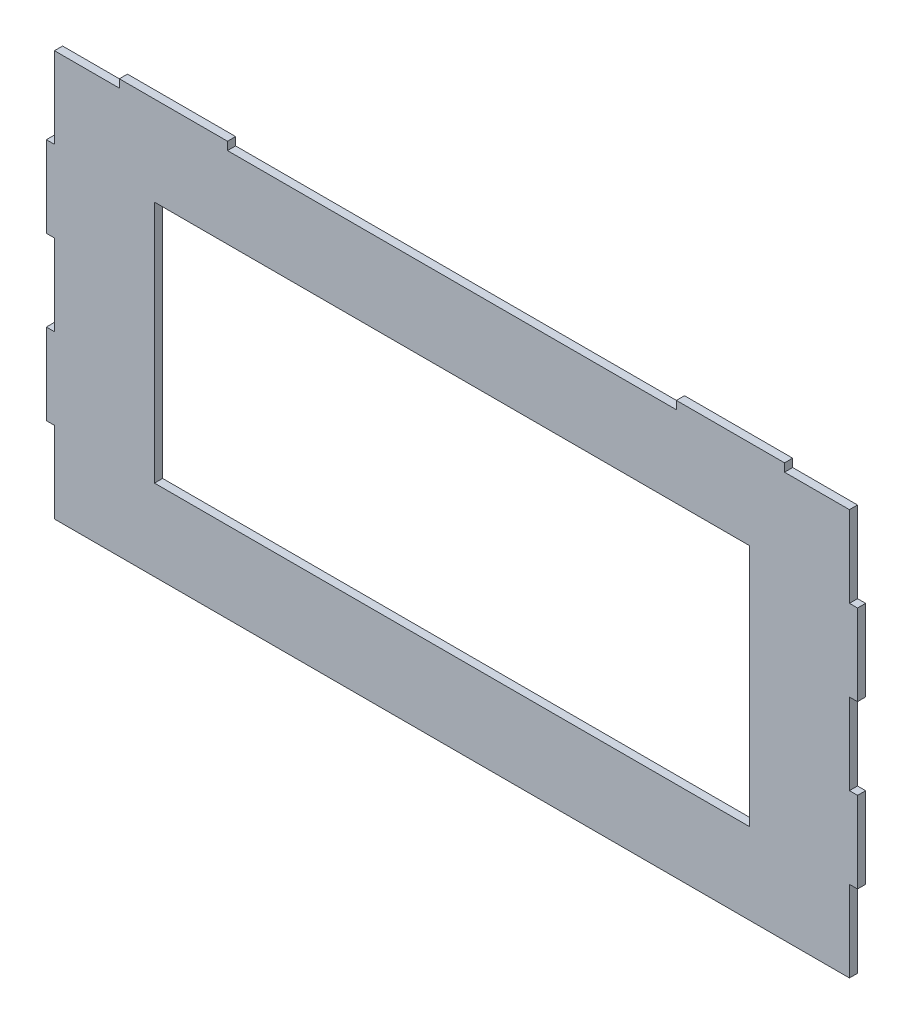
ISO-10303-21;
HEADER;
FILE_DESCRIPTION(('STEP AP214'),'2;1');
FILE_NAME('part.step','',(''),(''),'','','');
FILE_SCHEMA(('AUTOMOTIVE_DESIGN { 1 0 10303 214 1 1 1 1 }'));
ENDSEC;
DATA;
#1=APPLICATION_CONTEXT('core data for automotive mechanical design processes');
#2=APPLICATION_PROTOCOL_DEFINITION('international standard','automotive_design',2000,#1);
#3=PRODUCT_CONTEXT('',#1,'mechanical');
#4=PRODUCT('Part','Part','',(#3));
#5=PRODUCT_RELATED_PRODUCT_CATEGORY('part','',(#4));
#6=PRODUCT_DEFINITION_FORMATION('','',#4);
#7=PRODUCT_DEFINITION_CONTEXT('part definition',#1,'design');
#8=PRODUCT_DEFINITION('design','',#6,#7);
#9=PRODUCT_DEFINITION_SHAPE('','',#8);
#10=(LENGTH_UNIT() NAMED_UNIT(*) SI_UNIT(.MILLI.,.METRE.));
#11=(NAMED_UNIT(*) PLANE_ANGLE_UNIT() SI_UNIT($,.RADIAN.));
#12=(NAMED_UNIT(*) SI_UNIT($,.STERADIAN.) SOLID_ANGLE_UNIT());
#13=UNCERTAINTY_MEASURE_WITH_UNIT(LENGTH_MEASURE(1.E-05),#10,'distance_accuracy_value','');
#14=(GEOMETRIC_REPRESENTATION_CONTEXT(3) GLOBAL_UNCERTAINTY_ASSIGNED_CONTEXT((#13)) GLOBAL_UNIT_ASSIGNED_CONTEXT((#10,
#11,#12)) REPRESENTATION_CONTEXT('',''));
#15=CARTESIAN_POINT('',(0.,0.,0.));
#16=DIRECTION('',(0.,0.,1.));
#17=DIRECTION('',(1.,0.,0.));
#18=AXIS2_PLACEMENT_3D('',#15,#16,#17);
#19=CARTESIAN_POINT('',(-147.,-75.,3.));
#20=DIRECTION('',(1.,0.,0.));
#21=DIRECTION('',(0.,0.,-1.));
#22=AXIS2_PLACEMENT_3D('',#19,#20,#21);
#23=PLANE('',#22);
#24=DIRECTION('',(0.,0.,1.));
#25=VECTOR('',#24,1.);
#26=CARTESIAN_POINT('',(-147.,-45.,0.));
#27=LINE('',#26,#25);
#28=CARTESIAN_POINT('',(-147.,-45.,0.));
#29=VERTEX_POINT('',#28);
#30=CARTESIAN_POINT('',(-147.,-45.,3.));
#31=VERTEX_POINT('',#30);
#32=EDGE_CURVE('E578',#29,#31,#27,.T.);
#33=ORIENTED_EDGE('',*,*,#32,.F.);
#34=DIRECTION('',(0.,-1.,0.));
#35=VECTOR('',#34,1.);
#36=CARTESIAN_POINT('',(-147.,-75.,0.));
#37=LINE('',#36,#35);
#38=CARTESIAN_POINT('',(-147.,-75.,0.));
#39=VERTEX_POINT('',#38);
#40=EDGE_CURVE('E267',#29,#39,#37,.T.);
#41=ORIENTED_EDGE('',*,*,#40,.T.);
#42=DIRECTION('',(0.,0.,-1.));
#43=VECTOR('',#42,1.);
#44=CARTESIAN_POINT('',(-147.,-75.,3.));
#45=LINE('',#44,#43);
#46=CARTESIAN_POINT('',(-147.,-75.,3.));
#47=VERTEX_POINT('',#46);
#48=EDGE_CURVE('E471',#47,#39,#45,.T.);
#49=ORIENTED_EDGE('',*,*,#48,.F.);
#50=DIRECTION('',(0.,-1.,0.));
#51=VECTOR('',#50,1.);
#52=CARTESIAN_POINT('',(-147.,-75.,3.));
#53=LINE('',#52,#51);
#54=EDGE_CURVE('E48',#31,#47,#53,.T.);
#55=ORIENTED_EDGE('',*,*,#54,.F.);
#56=EDGE_LOOP('',(#33,#41,#49,#55));
#57=FACE_BOUND('',#56,.T.);
#58=ADVANCED_FACE('F33',(#57),#23,.F.);
#59=DIRECTION('',(0.,0.,-1.));
#60=VECTOR('',#59,1.);
#61=CARTESIAN_POINT('',(-147.,-15.,0.));
#62=LINE('',#61,#60);
#63=CARTESIAN_POINT('',(-147.,-15.,3.));
#64=VERTEX_POINT('',#63);
#65=CARTESIAN_POINT('',(-147.,-15.,0.));
#66=VERTEX_POINT('',#65);
#67=EDGE_CURVE('E56',#64,#66,#62,.T.);
#68=ORIENTED_EDGE('',*,*,#67,.F.);
#69=CARTESIAN_POINT('',(-147.,15.,3.));
#70=VERTEX_POINT('',#69);
#71=EDGE_CURVE('E454',#70,#64,#53,.T.);
#72=ORIENTED_EDGE('',*,*,#71,.F.);
#73=DIRECTION('',(0.,0.,1.));
#74=VECTOR('',#73,1.);
#75=CARTESIAN_POINT('',(-147.,15.,0.));
#76=LINE('',#75,#74);
#77=CARTESIAN_POINT('',(-147.,15.,0.));
#78=VERTEX_POINT('',#77);
#79=EDGE_CURVE('E268',#78,#70,#76,.T.);
#80=ORIENTED_EDGE('',*,*,#79,.F.);
#81=EDGE_CURVE('E467',#78,#66,#37,.T.);
#82=ORIENTED_EDGE('',*,*,#81,.T.);
#83=EDGE_LOOP('',(#68,#72,#80,#82));
#84=FACE_BOUND('',#83,.T.);
#85=ADVANCED_FACE('F522',(#84),#23,.F.);
#86=DIRECTION('',(0.,0.,-1.));
#87=VECTOR('',#86,1.);
#88=CARTESIAN_POINT('',(-147.,45.,0.));
#89=LINE('',#88,#87);
#90=CARTESIAN_POINT('',(-147.,45.,3.));
#91=VERTEX_POINT('',#90);
#92=CARTESIAN_POINT('',(-147.,45.,0.));
#93=VERTEX_POINT('',#92);
#94=EDGE_CURVE('E271',#91,#93,#89,.T.);
#95=ORIENTED_EDGE('',*,*,#94,.F.);
#96=CARTESIAN_POINT('',(-147.,75.,3.));
#97=VERTEX_POINT('',#96);
#98=EDGE_CURVE('E450',#97,#91,#53,.T.);
#99=ORIENTED_EDGE('',*,*,#98,.F.);
#100=DIRECTION('',(0.,0.,-1.));
#101=VECTOR('',#100,1.);
#102=CARTESIAN_POINT('',(-147.,75.,3.));
#103=LINE('',#102,#101);
#104=CARTESIAN_POINT('',(-147.,75.,0.));
#105=VERTEX_POINT('',#104);
#106=EDGE_CURVE('E41',#97,#105,#103,.T.);
#107=ORIENTED_EDGE('',*,*,#106,.T.);
#108=EDGE_CURVE('E464',#105,#93,#37,.T.);
#109=ORIENTED_EDGE('',*,*,#108,.T.);
#110=EDGE_LOOP('',(#95,#99,#107,#109));
#111=FACE_BOUND('',#110,.T.);
#112=ADVANCED_FACE('F478',(#111),#23,.F.);
#113=CARTESIAN_POINT('',(147.,-75.,3.));
#114=DIRECTION('',(-1.,0.,0.));
#115=DIRECTION('',(0.,0.,1.));
#116=AXIS2_PLACEMENT_3D('',#113,#114,#115);
#117=PLANE('',#116);
#118=DIRECTION('',(0.,0.,-1.));
#119=VECTOR('',#118,1.);
#120=CARTESIAN_POINT('',(147.,-45.,3.));
#121=LINE('',#120,#119);
#122=CARTESIAN_POINT('',(147.,-45.,3.));
#123=VERTEX_POINT('',#122);
#124=CARTESIAN_POINT('',(147.,-45.,0.));
#125=VERTEX_POINT('',#124);
#126=EDGE_CURVE('E300',#123,#125,#121,.T.);
#127=ORIENTED_EDGE('',*,*,#126,.F.);
#128=DIRECTION('',(0.,1.,0.));
#129=VECTOR('',#128,1.);
#130=CARTESIAN_POINT('',(147.,-75.,3.));
#131=LINE('',#130,#129);
#132=CARTESIAN_POINT('',(147.,-75.,3.));
#133=VERTEX_POINT('',#132);
#134=EDGE_CURVE('E440',#133,#123,#131,.T.);
#135=ORIENTED_EDGE('',*,*,#134,.F.);
#136=DIRECTION('',(0.,0.,-1.));
#137=VECTOR('',#136,1.);
#138=CARTESIAN_POINT('',(147.,-75.,3.));
#139=LINE('',#138,#137);
#140=CARTESIAN_POINT('',(147.,-75.,0.));
#141=VERTEX_POINT('',#140);
#142=EDGE_CURVE('E456',#133,#141,#139,.T.);
#143=ORIENTED_EDGE('',*,*,#142,.T.);
#144=DIRECTION('',(0.,1.,0.));
#145=VECTOR('',#144,1.);
#146=CARTESIAN_POINT('',(147.,-75.,0.));
#147=LINE('',#146,#145);
#148=EDGE_CURVE('E457',#141,#125,#147,.T.);
#149=ORIENTED_EDGE('',*,*,#148,.T.);
#150=EDGE_LOOP('',(#127,#135,#143,#149));
#151=FACE_BOUND('',#150,.T.);
#152=ADVANCED_FACE('F528',(#151),#117,.F.);
#153=DIRECTION('',(0.,0.,1.));
#154=VECTOR('',#153,1.);
#155=CARTESIAN_POINT('',(147.,-15.,3.));
#156=LINE('',#155,#154);
#157=CARTESIAN_POINT('',(147.,-15.,0.));
#158=VERTEX_POINT('',#157);
#159=CARTESIAN_POINT('',(147.,-15.,3.));
#160=VERTEX_POINT('',#159);
#161=EDGE_CURVE('E305',#158,#160,#156,.T.);
#162=ORIENTED_EDGE('',*,*,#161,.F.);
#163=CARTESIAN_POINT('',(147.,15.,0.));
#164=VERTEX_POINT('',#163);
#165=EDGE_CURVE('E460',#158,#164,#147,.T.);
#166=ORIENTED_EDGE('',*,*,#165,.T.);
#167=DIRECTION('',(0.,0.,-1.));
#168=VECTOR('',#167,1.);
#169=CARTESIAN_POINT('',(147.,15.,2.99999999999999));
#170=LINE('',#169,#168);
#171=CARTESIAN_POINT('',(147.,15.,3.));
#172=VERTEX_POINT('',#171);
#173=EDGE_CURVE('E327',#172,#164,#170,.T.);
#174=ORIENTED_EDGE('',*,*,#173,.F.);
#175=EDGE_CURVE('E444',#160,#172,#131,.T.);
#176=ORIENTED_EDGE('',*,*,#175,.F.);
#177=EDGE_LOOP('',(#162,#166,#174,#176));
#178=FACE_BOUND('',#177,.T.);
#179=ADVANCED_FACE('F532',(#178),#117,.F.);
#180=DIRECTION('',(0.,0.,1.));
#181=VECTOR('',#180,1.);
#182=CARTESIAN_POINT('',(147.,45.,3.));
#183=LINE('',#182,#181);
#184=CARTESIAN_POINT('',(147.,45.,0.));
#185=VERTEX_POINT('',#184);
#186=CARTESIAN_POINT('',(147.,45.,3.));
#187=VERTEX_POINT('',#186);
#188=EDGE_CURVE('E332',#185,#187,#183,.T.);
#189=ORIENTED_EDGE('',*,*,#188,.F.);
#190=CARTESIAN_POINT('',(147.,75.,0.));
#191=VERTEX_POINT('',#190);
#192=EDGE_CURVE('E439',#185,#191,#147,.T.);
#193=ORIENTED_EDGE('',*,*,#192,.T.);
#194=DIRECTION('',(0.,0.,-1.));
#195=VECTOR('',#194,1.);
#196=CARTESIAN_POINT('',(147.,75.,3.));
#197=LINE('',#196,#195);
#198=CARTESIAN_POINT('',(147.,75.,3.));
#199=VERTEX_POINT('',#198);
#200=EDGE_CURVE('E11',#199,#191,#197,.T.);
#201=ORIENTED_EDGE('',*,*,#200,.F.);
#202=EDGE_CURVE('E445',#187,#199,#131,.T.);
#203=ORIENTED_EDGE('',*,*,#202,.F.);
#204=EDGE_LOOP('',(#189,#193,#201,#203));
#205=FACE_BOUND('',#204,.T.);
#206=ADVANCED_FACE('F35',(#205),#117,.F.);
#207=CARTESIAN_POINT('',(-147.,75.,3.));
#208=DIRECTION('',(0.,-1.,0.));
#209=DIRECTION('',(0.,0.,-1.));
#210=AXIS2_PLACEMENT_3D('',#207,#208,#209);
#211=PLANE('',#210);
#212=DIRECTION('',(0.,0.,1.));
#213=VECTOR('',#212,1.);
#214=CARTESIAN_POINT('',(83.,75.,3.));
#215=LINE('',#214,#213);
#216=CARTESIAN_POINT('',(83.,75.,0.));
#217=VERTEX_POINT('',#216);
#218=CARTESIAN_POINT('',(83.,75.,3.));
#219=VERTEX_POINT('',#218);
#220=EDGE_CURVE('E354',#217,#219,#215,.T.);
#221=ORIENTED_EDGE('',*,*,#220,.F.);
#222=DIRECTION('',(-1.,0.,0.));
#223=VECTOR('',#222,1.);
#224=CARTESIAN_POINT('',(-147.,75.,0.));
#225=LINE('',#224,#223);
#226=CARTESIAN_POINT('',(-83.,75.,0.));
#227=VERTEX_POINT('',#226);
#228=EDGE_CURVE('E463',#217,#227,#225,.T.);
#229=ORIENTED_EDGE('',*,*,#228,.T.);
#230=DIRECTION('',(0.,0.,-1.));
#231=VECTOR('',#230,1.);
#232=CARTESIAN_POINT('',(-83.,75.,3.));
#233=LINE('',#232,#231);
#234=CARTESIAN_POINT('',(-83.,75.,3.));
#235=VERTEX_POINT('',#234);
#236=EDGE_CURVE('E386',#235,#227,#233,.T.);
#237=ORIENTED_EDGE('',*,*,#236,.F.);
#238=DIRECTION('',(-1.,0.,0.));
#239=VECTOR('',#238,1.);
#240=CARTESIAN_POINT('',(-147.,75.,3.));
#241=LINE('',#240,#239);
#242=EDGE_CURVE('E449',#219,#235,#241,.T.);
#243=ORIENTED_EDGE('',*,*,#242,.F.);
#244=EDGE_LOOP('',(#221,#229,#237,#243));
#245=FACE_BOUND('',#244,.T.);
#246=ADVANCED_FACE('F500',(#245),#211,.F.);
#247=DIRECTION('',(0.,0.,-1.));
#248=VECTOR('',#247,1.);
#249=CARTESIAN_POINT('',(123.,75.,3.));
#250=LINE('',#249,#248);
#251=CARTESIAN_POINT('',(123.,75.,3.));
#252=VERTEX_POINT('',#251);
#253=CARTESIAN_POINT('',(123.,75.,0.));
#254=VERTEX_POINT('',#253);
#255=EDGE_CURVE('E359',#252,#254,#250,.T.);
#256=ORIENTED_EDGE('',*,*,#255,.F.);
#257=EDGE_CURVE('E446',#199,#252,#241,.T.);
#258=ORIENTED_EDGE('',*,*,#257,.F.);
#259=ORIENTED_EDGE('',*,*,#200,.T.);
#260=EDGE_CURVE('E461',#191,#254,#225,.T.);
#261=ORIENTED_EDGE('',*,*,#260,.T.);
#262=EDGE_LOOP('',(#256,#258,#259,#261));
#263=FACE_BOUND('',#262,.T.);
#264=ADVANCED_FACE('F512',(#263),#211,.F.);
#265=DIRECTION('',(0.,0.,1.));
#266=VECTOR('',#265,1.);
#267=CARTESIAN_POINT('',(-123.,75.,3.));
#268=LINE('',#267,#266);
#269=CARTESIAN_POINT('',(-123.,75.,0.));
#270=VERTEX_POINT('',#269);
#271=CARTESIAN_POINT('',(-123.,75.,3.));
#272=VERTEX_POINT('',#271);
#273=EDGE_CURVE('E381',#270,#272,#268,.T.);
#274=ORIENTED_EDGE('',*,*,#273,.F.);
#275=EDGE_CURVE('E459',#270,#105,#225,.T.);
#276=ORIENTED_EDGE('',*,*,#275,.T.);
#277=ORIENTED_EDGE('',*,*,#106,.F.);
#278=EDGE_CURVE('E443',#272,#97,#241,.T.);
#279=ORIENTED_EDGE('',*,*,#278,.F.);
#280=EDGE_LOOP('',(#274,#276,#277,#279));
#281=FACE_BOUND('',#280,.T.);
#282=ADVANCED_FACE('F510',(#281),#211,.F.);
#283=CARTESIAN_POINT('',(0.,0.,3.));
#284=DIRECTION('',(0.,0.,-1.));
#285=DIRECTION('',(-1.,0.,0.));
#286=AXIS2_PLACEMENT_3D('',#283,#284,#285);
#287=PLANE('',#286);
#288=ORIENTED_EDGE('',*,*,#134,.T.);
#289=DIRECTION('',(-1.,0.,0.));
#290=VECTOR('',#289,1.);
#291=CARTESIAN_POINT('',(150.,-45.,3.));
#292=LINE('',#291,#290);
#293=CARTESIAN_POINT('',(150.,-45.,3.));
#294=VERTEX_POINT('',#293);
#295=EDGE_CURVE('E324',#294,#123,#292,.T.);
#296=ORIENTED_EDGE('',*,*,#295,.F.);
#297=DIRECTION('',(0.,-1.,0.));
#298=VECTOR('',#297,1.);
#299=CARTESIAN_POINT('',(150.,-15.,3.));
#300=LINE('',#299,#298);
#301=CARTESIAN_POINT('',(150.,-15.,3.));
#302=VERTEX_POINT('',#301);
#303=EDGE_CURVE('E301',#302,#294,#300,.T.);
#304=ORIENTED_EDGE('',*,*,#303,.F.);
#305=DIRECTION('',(-1.,0.,0.));
#306=VECTOR('',#305,1.);
#307=CARTESIAN_POINT('',(150.,-15.,3.));
#308=LINE('',#307,#306);
#309=EDGE_CURVE('E311',#302,#160,#308,.T.);
#310=ORIENTED_EDGE('',*,*,#309,.T.);
#311=ORIENTED_EDGE('',*,*,#175,.T.);
#312=DIRECTION('',(-1.,0.,0.));
#313=VECTOR('',#312,1.);
#314=CARTESIAN_POINT('',(150.,15.,2.99999999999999));
#315=LINE('',#314,#313);
#316=CARTESIAN_POINT('',(150.,15.,2.99999999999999));
#317=VERTEX_POINT('',#316);
#318=EDGE_CURVE('E351',#317,#172,#315,.T.);
#319=ORIENTED_EDGE('',*,*,#318,.F.);
#320=DIRECTION('',(0.,-1.,0.));
#321=VECTOR('',#320,1.);
#322=CARTESIAN_POINT('',(150.,45.,3.));
#323=LINE('',#322,#321);
#324=CARTESIAN_POINT('',(150.,45.,3.));
#325=VERTEX_POINT('',#324);
#326=EDGE_CURVE('E328',#325,#317,#323,.T.);
#327=ORIENTED_EDGE('',*,*,#326,.F.);
#328=DIRECTION('',(-1.,0.,0.));
#329=VECTOR('',#328,1.);
#330=CARTESIAN_POINT('',(150.,45.,3.));
#331=LINE('',#330,#329);
#332=EDGE_CURVE('E338',#325,#187,#331,.T.);
#333=ORIENTED_EDGE('',*,*,#332,.T.);
#334=ORIENTED_EDGE('',*,*,#202,.T.);
#335=ORIENTED_EDGE('',*,*,#257,.T.);
#336=DIRECTION('',(0.,-1.,0.));
#337=VECTOR('',#336,1.);
#338=CARTESIAN_POINT('',(123.,78.,3.));
#339=LINE('',#338,#337);
#340=CARTESIAN_POINT('',(123.,78.,3.));
#341=VERTEX_POINT('',#340);
#342=EDGE_CURVE('E375',#341,#252,#339,.T.);
#343=ORIENTED_EDGE('',*,*,#342,.F.);
#344=DIRECTION('',(1.,0.,0.));
#345=VECTOR('',#344,1.);
#346=CARTESIAN_POINT('',(83.,78.,3.));
#347=LINE('',#346,#345);
#348=CARTESIAN_POINT('',(83.,78.,3.));
#349=VERTEX_POINT('',#348);
#350=EDGE_CURVE('E358',#349,#341,#347,.T.);
#351=ORIENTED_EDGE('',*,*,#350,.F.);
#352=DIRECTION('',(0.,-1.,0.));
#353=VECTOR('',#352,1.);
#354=CARTESIAN_POINT('',(83.,78.,3.));
#355=LINE('',#354,#353);
#356=EDGE_CURVE('E378',#349,#219,#355,.T.);
#357=ORIENTED_EDGE('',*,*,#356,.T.);
#358=ORIENTED_EDGE('',*,*,#242,.T.);
#359=DIRECTION('',(0.,-1.,0.));
#360=VECTOR('',#359,1.);
#361=CARTESIAN_POINT('',(-83.,78.,3.));
#362=LINE('',#361,#360);
#363=CARTESIAN_POINT('',(-83.,78.,3.));
#364=VERTEX_POINT('',#363);
#365=EDGE_CURVE('E402',#364,#235,#362,.T.);
#366=ORIENTED_EDGE('',*,*,#365,.F.);
#367=DIRECTION('',(1.,0.,0.));
#368=VECTOR('',#367,1.);
#369=CARTESIAN_POINT('',(-123.,78.,3.));
#370=LINE('',#369,#368);
#371=CARTESIAN_POINT('',(-123.,78.,3.));
#372=VERTEX_POINT('',#371);
#373=EDGE_CURVE('E385',#372,#364,#370,.T.);
#374=ORIENTED_EDGE('',*,*,#373,.F.);
#375=DIRECTION('',(0.,-1.,0.));
#376=VECTOR('',#375,1.);
#377=CARTESIAN_POINT('',(-123.,78.,3.));
#378=LINE('',#377,#376);
#379=EDGE_CURVE('E405',#372,#272,#378,.T.);
#380=ORIENTED_EDGE('',*,*,#379,.T.);
#381=ORIENTED_EDGE('',*,*,#278,.T.);
#382=ORIENTED_EDGE('',*,*,#98,.T.);
#383=DIRECTION('',(1.,0.,0.));
#384=VECTOR('',#383,1.);
#385=CARTESIAN_POINT('',(-150.,45.,3.));
#386=LINE('',#385,#384);
#387=CARTESIAN_POINT('',(-150.,45.,3.));
#388=VERTEX_POINT('',#387);
#389=EDGE_CURVE('E291',#388,#91,#386,.T.);
#390=ORIENTED_EDGE('',*,*,#389,.F.);
#391=DIRECTION('',(0.,1.,0.));
#392=VECTOR('',#391,1.);
#393=CARTESIAN_POINT('',(-150.,45.,3.));
#394=LINE('',#393,#392);
#395=CARTESIAN_POINT('',(-150.,15.,3.));
#396=VERTEX_POINT('',#395);
#397=EDGE_CURVE('E282',#396,#388,#394,.T.);
#398=ORIENTED_EDGE('',*,*,#397,.F.);
#399=DIRECTION('',(1.,0.,0.));
#400=VECTOR('',#399,1.);
#401=CARTESIAN_POINT('',(-150.,15.,3.));
#402=LINE('',#401,#400);
#403=EDGE_CURVE('E294',#396,#70,#402,.T.);
#404=ORIENTED_EDGE('',*,*,#403,.T.);
#405=ORIENTED_EDGE('',*,*,#71,.T.);
#406=DIRECTION('',(1.,0.,0.));
#407=VECTOR('',#406,1.);
#408=CARTESIAN_POINT('',(-150.,-15.,3.));
#409=LINE('',#408,#407);
#410=CARTESIAN_POINT('',(-150.,-15.,3.));
#411=VERTEX_POINT('',#410);
#412=EDGE_CURVE('E273',#411,#64,#409,.T.);
#413=ORIENTED_EDGE('',*,*,#412,.F.);
#414=DIRECTION('',(0.,1.,0.));
#415=VECTOR('',#414,1.);
#416=CARTESIAN_POINT('',(-150.,-15.,3.));
#417=LINE('',#416,#415);
#418=CARTESIAN_POINT('',(-150.,-45.,3.));
#419=VERTEX_POINT('',#418);
#420=EDGE_CURVE('E252',#419,#411,#417,.T.);
#421=ORIENTED_EDGE('',*,*,#420,.F.);
#422=DIRECTION('',(1.,0.,0.));
#423=VECTOR('',#422,1.);
#424=CARTESIAN_POINT('',(-150.,-45.,3.));
#425=LINE('',#424,#423);
#426=EDGE_CURVE('E249',#419,#31,#425,.T.);
#427=ORIENTED_EDGE('',*,*,#426,.T.);
#428=ORIENTED_EDGE('',*,*,#54,.T.);
#429=DIRECTION('',(1.,0.,0.));
#430=VECTOR('',#429,1.);
#431=CARTESIAN_POINT('',(-147.,-75.,3.));
#432=LINE('',#431,#430);
#433=EDGE_CURVE('E453',#47,#133,#432,.T.);
#434=ORIENTED_EDGE('',*,*,#433,.T.);
#435=EDGE_LOOP('',(#288,#296,#304,#310,#311,#319,#327,#333,#334,#335,#343,#351,#357,#358,#366,
#374,#380,#381,#382,#390,#398,#404,#405,#413,#421,#427,#428,#434));
#436=FACE_BOUND('',#435,.T.);
#437=DIRECTION('',(0.,1.,0.));
#438=VECTOR('',#437,1.);
#439=CARTESIAN_POINT('',(110.,-45.,3.));
#440=LINE('',#439,#438);
#441=CARTESIAN_POINT('',(110.,-45.,3.));
#442=VERTEX_POINT('',#441);
#443=CARTESIAN_POINT('',(110.,45.,3.));
#444=VERTEX_POINT('',#443);
#445=EDGE_CURVE('E409',#442,#444,#440,.T.);
#446=ORIENTED_EDGE('',*,*,#445,.F.);
#447=DIRECTION('',(1.,0.,0.));
#448=VECTOR('',#447,1.);
#449=CARTESIAN_POINT('',(-110.,-45.,3.));
#450=LINE('',#449,#448);
#451=CARTESIAN_POINT('',(-110.,-45.,3.));
#452=VERTEX_POINT('',#451);
#453=EDGE_CURVE('E417',#452,#442,#450,.T.);
#454=ORIENTED_EDGE('',*,*,#453,.F.);
#455=DIRECTION('',(0.,-1.,0.));
#456=VECTOR('',#455,1.);
#457=CARTESIAN_POINT('',(-110.,-45.,3.));
#458=LINE('',#457,#456);
#459=CARTESIAN_POINT('',(-110.,45.,3.));
#460=VERTEX_POINT('',#459);
#461=EDGE_CURVE('E414',#460,#452,#458,.T.);
#462=ORIENTED_EDGE('',*,*,#461,.F.);
#463=DIRECTION('',(-1.,0.,0.));
#464=VECTOR('',#463,1.);
#465=CARTESIAN_POINT('',(-110.,45.,3.));
#466=LINE('',#465,#464);
#467=EDGE_CURVE('E411',#444,#460,#466,.T.);
#468=ORIENTED_EDGE('',*,*,#467,.F.);
#469=EDGE_LOOP('',(#446,#454,#462,#468));
#470=FACE_BOUND('',#469,.T.);
#471=ADVANCED_FACE('F490',(#436,#470),#287,.F.);
#472=CARTESIAN_POINT('',(0.,0.,0.));
#473=DIRECTION('',(0.,0.,-1.));
#474=DIRECTION('',(-1.,0.,0.));
#475=AXIS2_PLACEMENT_3D('',#472,#473,#474);
#476=PLANE('',#475);
#477=ORIENTED_EDGE('',*,*,#148,.F.);
#478=DIRECTION('',(1.,0.,0.));
#479=VECTOR('',#478,1.);
#480=CARTESIAN_POINT('',(-147.,-75.,0.));
#481=LINE('',#480,#479);
#482=EDGE_CURVE('E466',#39,#141,#481,.T.);
#483=ORIENTED_EDGE('',*,*,#482,.F.);
#484=ORIENTED_EDGE('',*,*,#40,.F.);
#485=DIRECTION('',(1.,0.,0.));
#486=VECTOR('',#485,1.);
#487=CARTESIAN_POINT('',(-150.,-45.,0.));
#488=LINE('',#487,#486);
#489=CARTESIAN_POINT('',(-150.,-45.,0.));
#490=VERTEX_POINT('',#489);
#491=EDGE_CURVE('E247',#490,#29,#488,.T.);
#492=ORIENTED_EDGE('',*,*,#491,.F.);
#493=DIRECTION('',(0.,-1.,0.));
#494=VECTOR('',#493,1.);
#495=CARTESIAN_POINT('',(-150.,-15.,0.));
#496=LINE('',#495,#494);
#497=CARTESIAN_POINT('',(-150.,-15.,0.));
#498=VERTEX_POINT('',#497);
#499=EDGE_CURVE('E253',#498,#490,#496,.T.);
#500=ORIENTED_EDGE('',*,*,#499,.F.);
#501=DIRECTION('',(1.,0.,0.));
#502=VECTOR('',#501,1.);
#503=CARTESIAN_POINT('',(-150.,-15.,0.));
#504=LINE('',#503,#502);
#505=EDGE_CURVE('E583',#498,#66,#504,.T.);
#506=ORIENTED_EDGE('',*,*,#505,.T.);
#507=ORIENTED_EDGE('',*,*,#81,.F.);
#508=DIRECTION('',(1.,0.,0.));
#509=VECTOR('',#508,1.);
#510=CARTESIAN_POINT('',(-150.,15.,0.));
#511=LINE('',#510,#509);
#512=CARTESIAN_POINT('',(-150.,15.,0.));
#513=VERTEX_POINT('',#512);
#514=EDGE_CURVE('E297',#513,#78,#511,.T.);
#515=ORIENTED_EDGE('',*,*,#514,.F.);
#516=DIRECTION('',(0.,-1.,0.));
#517=VECTOR('',#516,1.);
#518=CARTESIAN_POINT('',(-150.,45.,0.));
#519=LINE('',#518,#517);
#520=CARTESIAN_POINT('',(-150.,45.,0.));
#521=VERTEX_POINT('',#520);
#522=EDGE_CURVE('E277',#521,#513,#519,.T.);
#523=ORIENTED_EDGE('',*,*,#522,.F.);
#524=DIRECTION('',(1.,0.,0.));
#525=VECTOR('',#524,1.);
#526=CARTESIAN_POINT('',(-150.,45.,0.));
#527=LINE('',#526,#525);
#528=EDGE_CURVE('E285',#521,#93,#527,.T.);
#529=ORIENTED_EDGE('',*,*,#528,.T.);
#530=ORIENTED_EDGE('',*,*,#108,.F.);
#531=ORIENTED_EDGE('',*,*,#275,.F.);
#532=DIRECTION('',(0.,-1.,0.));
#533=VECTOR('',#532,1.);
#534=CARTESIAN_POINT('',(-123.,78.,0.));
#535=LINE('',#534,#533);
#536=CARTESIAN_POINT('',(-123.,78.,0.));
#537=VERTEX_POINT('',#536);
#538=EDGE_CURVE('E392',#537,#270,#535,.T.);
#539=ORIENTED_EDGE('',*,*,#538,.F.);
#540=DIRECTION('',(-1.,0.,0.));
#541=VECTOR('',#540,1.);
#542=CARTESIAN_POINT('',(-123.,78.,0.));
#543=LINE('',#542,#541);
#544=CARTESIAN_POINT('',(-83.,78.,0.));
#545=VERTEX_POINT('',#544);
#546=EDGE_CURVE('E390',#545,#537,#543,.T.);
#547=ORIENTED_EDGE('',*,*,#546,.F.);
#548=DIRECTION('',(0.,-1.,0.));
#549=VECTOR('',#548,1.);
#550=CARTESIAN_POINT('',(-83.,78.,0.));
#551=LINE('',#550,#549);
#552=EDGE_CURVE('E399',#545,#227,#551,.T.);
#553=ORIENTED_EDGE('',*,*,#552,.T.);
#554=ORIENTED_EDGE('',*,*,#228,.F.);
#555=DIRECTION('',(0.,-1.,0.));
#556=VECTOR('',#555,1.);
#557=CARTESIAN_POINT('',(83.,78.,0.));
#558=LINE('',#557,#556);
#559=CARTESIAN_POINT('',(83.,78.,0.));
#560=VERTEX_POINT('',#559);
#561=EDGE_CURVE('E365',#560,#217,#558,.T.);
#562=ORIENTED_EDGE('',*,*,#561,.F.);
#563=DIRECTION('',(-1.,0.,0.));
#564=VECTOR('',#563,1.);
#565=CARTESIAN_POINT('',(83.,78.,0.));
#566=LINE('',#565,#564);
#567=CARTESIAN_POINT('',(123.,78.,0.));
#568=VERTEX_POINT('',#567);
#569=EDGE_CURVE('E363',#568,#560,#566,.T.);
#570=ORIENTED_EDGE('',*,*,#569,.F.);
#571=DIRECTION('',(0.,-1.,0.));
#572=VECTOR('',#571,1.);
#573=CARTESIAN_POINT('',(123.,78.,0.));
#574=LINE('',#573,#572);
#575=EDGE_CURVE('E372',#568,#254,#574,.T.);
#576=ORIENTED_EDGE('',*,*,#575,.T.);
#577=ORIENTED_EDGE('',*,*,#260,.F.);
#578=ORIENTED_EDGE('',*,*,#192,.F.);
#579=DIRECTION('',(-1.,0.,0.));
#580=VECTOR('',#579,1.);
#581=CARTESIAN_POINT('',(150.,45.,0.));
#582=LINE('',#581,#580);
#583=CARTESIAN_POINT('',(150.,45.,0.));
#584=VERTEX_POINT('',#583);
#585=EDGE_CURVE('E345',#584,#185,#582,.T.);
#586=ORIENTED_EDGE('',*,*,#585,.F.);
#587=DIRECTION('',(0.,1.,0.));
#588=VECTOR('',#587,1.);
#589=CARTESIAN_POINT('',(150.,45.,0.));
#590=LINE('',#589,#588);
#591=CARTESIAN_POINT('',(150.,15.,0.));
#592=VERTEX_POINT('',#591);
#593=EDGE_CURVE('E334',#592,#584,#590,.T.);
#594=ORIENTED_EDGE('',*,*,#593,.F.);
#595=DIRECTION('',(-1.,0.,0.));
#596=VECTOR('',#595,1.);
#597=CARTESIAN_POINT('',(150.,15.,0.));
#598=LINE('',#597,#596);
#599=EDGE_CURVE('E348',#592,#164,#598,.T.);
#600=ORIENTED_EDGE('',*,*,#599,.T.);
#601=ORIENTED_EDGE('',*,*,#165,.F.);
#602=DIRECTION('',(-1.,0.,0.));
#603=VECTOR('',#602,1.);
#604=CARTESIAN_POINT('',(150.,-15.,0.));
#605=LINE('',#604,#603);
#606=CARTESIAN_POINT('',(150.,-15.,0.));
#607=VERTEX_POINT('',#606);
#608=EDGE_CURVE('E318',#607,#158,#605,.T.);
#609=ORIENTED_EDGE('',*,*,#608,.F.);
#610=DIRECTION('',(0.,1.,0.));
#611=VECTOR('',#610,1.);
#612=CARTESIAN_POINT('',(150.,-15.,0.));
#613=LINE('',#612,#611);
#614=CARTESIAN_POINT('',(150.,-45.,0.));
#615=VERTEX_POINT('',#614);
#616=EDGE_CURVE('E307',#615,#607,#613,.T.);
#617=ORIENTED_EDGE('',*,*,#616,.F.);
#618=DIRECTION('',(-1.,0.,0.));
#619=VECTOR('',#618,1.);
#620=CARTESIAN_POINT('',(150.,-45.,0.));
#621=LINE('',#620,#619);
#622=EDGE_CURVE('E321',#615,#125,#621,.T.);
#623=ORIENTED_EDGE('',*,*,#622,.T.);
#624=EDGE_LOOP('',(#477,#483,#484,#492,#500,#506,#507,#515,#523,#529,#530,#531,#539,#547,#553,
#554,#562,#570,#576,#577,#578,#586,#594,#600,#601,#609,#617,#623));
#625=FACE_BOUND('',#624,.T.);
#626=DIRECTION('',(1.,0.,0.));
#627=VECTOR('',#626,1.);
#628=CARTESIAN_POINT('',(-110.,-45.,0.));
#629=LINE('',#628,#627);
#630=CARTESIAN_POINT('',(-110.,-45.,0.));
#631=VERTEX_POINT('',#630);
#632=CARTESIAN_POINT('',(110.,-45.,0.));
#633=VERTEX_POINT('',#632);
#634=EDGE_CURVE('E412',#631,#633,#629,.T.);
#635=ORIENTED_EDGE('',*,*,#634,.T.);
#636=DIRECTION('',(0.,1.,0.));
#637=VECTOR('',#636,1.);
#638=CARTESIAN_POINT('',(110.,-45.,0.));
#639=LINE('',#638,#637);
#640=CARTESIAN_POINT('',(110.,45.,0.));
#641=VERTEX_POINT('',#640);
#642=EDGE_CURVE('E408',#633,#641,#639,.T.);
#643=ORIENTED_EDGE('',*,*,#642,.T.);
#644=DIRECTION('',(-1.,0.,0.));
#645=VECTOR('',#644,1.);
#646=CARTESIAN_POINT('',(-110.,45.,0.));
#647=LINE('',#646,#645);
#648=CARTESIAN_POINT('',(-110.,45.,0.));
#649=VERTEX_POINT('',#648);
#650=EDGE_CURVE('E422',#641,#649,#647,.T.);
#651=ORIENTED_EDGE('',*,*,#650,.T.);
#652=DIRECTION('',(0.,-1.,0.));
#653=VECTOR('',#652,1.);
#654=CARTESIAN_POINT('',(-110.,-45.,0.));
#655=LINE('',#654,#653);
#656=EDGE_CURVE('E425',#649,#631,#655,.T.);
#657=ORIENTED_EDGE('',*,*,#656,.T.);
#658=EDGE_LOOP('',(#635,#643,#651,#657));
#659=FACE_BOUND('',#658,.T.);
#660=ADVANCED_FACE('F264',(#625,#659),#476,.T.);
#661=CARTESIAN_POINT('',(-147.,-75.,3.));
#662=DIRECTION('',(0.,1.,0.));
#663=DIRECTION('',(0.,0.,1.));
#664=AXIS2_PLACEMENT_3D('',#661,#662,#663);
#665=PLANE('',#664);
#666=ORIENTED_EDGE('',*,*,#482,.T.);
#667=ORIENTED_EDGE('',*,*,#142,.F.);
#668=ORIENTED_EDGE('',*,*,#433,.F.);
#669=ORIENTED_EDGE('',*,*,#48,.T.);
#670=EDGE_LOOP('',(#666,#667,#668,#669));
#671=FACE_BOUND('',#670,.T.);
#672=ADVANCED_FACE('F577',(#671),#665,.F.);
#673=CARTESIAN_POINT('',(110.,-45.,3.));
#674=DIRECTION('',(-1.,0.,0.));
#675=DIRECTION('',(0.,0.,1.));
#676=AXIS2_PLACEMENT_3D('',#673,#674,#675);
#677=PLANE('',#676);
#678=ORIENTED_EDGE('',*,*,#642,.F.);
#679=DIRECTION('',(0.,0.,-1.));
#680=VECTOR('',#679,1.);
#681=CARTESIAN_POINT('',(110.,-45.,3.));
#682=LINE('',#681,#680);
#683=EDGE_CURVE('E419',#442,#633,#682,.T.);
#684=ORIENTED_EDGE('',*,*,#683,.F.);
#685=ORIENTED_EDGE('',*,*,#445,.T.);
#686=DIRECTION('',(0.,0.,-1.));
#687=VECTOR('',#686,1.);
#688=CARTESIAN_POINT('',(110.,45.,3.));
#689=LINE('',#688,#687);
#690=EDGE_CURVE('E436',#444,#641,#689,.T.);
#691=ORIENTED_EDGE('',*,*,#690,.T.);
#692=EDGE_LOOP('',(#678,#684,#685,#691));
#693=FACE_BOUND('',#692,.T.);
#694=ADVANCED_FACE('F648',(#693),#677,.T.);
#695=CARTESIAN_POINT('',(-110.,45.,3.));
#696=DIRECTION('',(0.,-1.,0.));
#697=DIRECTION('',(0.,0.,-1.));
#698=AXIS2_PLACEMENT_3D('',#695,#696,#697);
#699=PLANE('',#698);
#700=ORIENTED_EDGE('',*,*,#650,.F.);
#701=ORIENTED_EDGE('',*,*,#690,.F.);
#702=ORIENTED_EDGE('',*,*,#467,.T.);
#703=DIRECTION('',(0.,0.,-1.));
#704=VECTOR('',#703,1.);
#705=CARTESIAN_POINT('',(-110.,45.,3.));
#706=LINE('',#705,#704);
#707=EDGE_CURVE('E434',#460,#649,#706,.T.);
#708=ORIENTED_EDGE('',*,*,#707,.T.);
#709=EDGE_LOOP('',(#700,#701,#702,#708));
#710=FACE_BOUND('',#709,.T.);
#711=ADVANCED_FACE('F644',(#710),#699,.T.);
#712=CARTESIAN_POINT('',(-110.,-45.,3.));
#713=DIRECTION('',(1.,0.,0.));
#714=DIRECTION('',(0.,0.,-1.));
#715=AXIS2_PLACEMENT_3D('',#712,#713,#714);
#716=PLANE('',#715);
#717=ORIENTED_EDGE('',*,*,#656,.F.);
#718=ORIENTED_EDGE('',*,*,#707,.F.);
#719=ORIENTED_EDGE('',*,*,#461,.T.);
#720=DIRECTION('',(0.,0.,-1.));
#721=VECTOR('',#720,1.);
#722=CARTESIAN_POINT('',(-110.,-45.,3.));
#723=LINE('',#722,#721);
#724=EDGE_CURVE('E432',#452,#631,#723,.T.);
#725=ORIENTED_EDGE('',*,*,#724,.T.);
#726=EDGE_LOOP('',(#717,#718,#719,#725));
#727=FACE_BOUND('',#726,.T.);
#728=ADVANCED_FACE('F640',(#727),#716,.T.);
#729=CARTESIAN_POINT('',(-110.,-45.,3.));
#730=DIRECTION('',(0.,1.,0.));
#731=DIRECTION('',(0.,0.,1.));
#732=AXIS2_PLACEMENT_3D('',#729,#730,#731);
#733=PLANE('',#732);
#734=ORIENTED_EDGE('',*,*,#634,.F.);
#735=ORIENTED_EDGE('',*,*,#724,.F.);
#736=ORIENTED_EDGE('',*,*,#453,.T.);
#737=ORIENTED_EDGE('',*,*,#683,.T.);
#738=EDGE_LOOP('',(#734,#735,#736,#737));
#739=FACE_BOUND('',#738,.T.);
#740=ADVANCED_FACE('F637',(#739),#733,.T.);
#741=CARTESIAN_POINT('',(-123.,78.,3.));
#742=DIRECTION('',(1.,0.,0.));
#743=DIRECTION('',(0.,0.,-1.));
#744=AXIS2_PLACEMENT_3D('',#741,#742,#743);
#745=PLANE('',#744);
#746=ORIENTED_EDGE('',*,*,#273,.T.);
#747=ORIENTED_EDGE('',*,*,#379,.F.);
#748=DIRECTION('',(0.,0.,1.));
#749=VECTOR('',#748,1.);
#750=CARTESIAN_POINT('',(-123.,78.,3.));
#751=LINE('',#750,#749);
#752=EDGE_CURVE('E382',#537,#372,#751,.T.);
#753=ORIENTED_EDGE('',*,*,#752,.F.);
#754=ORIENTED_EDGE('',*,*,#538,.T.);
#755=EDGE_LOOP('',(#746,#747,#753,#754));
#756=FACE_BOUND('',#755,.T.);
#757=ADVANCED_FACE('F509',(#756),#745,.F.);
#758=CARTESIAN_POINT('',(-83.,78.,3.));
#759=DIRECTION('',(-1.,0.,0.));
#760=DIRECTION('',(0.,0.,1.));
#761=AXIS2_PLACEMENT_3D('',#758,#759,#760);
#762=PLANE('',#761);
#763=ORIENTED_EDGE('',*,*,#236,.T.);
#764=ORIENTED_EDGE('',*,*,#552,.F.);
#765=DIRECTION('',(0.,0.,-1.));
#766=VECTOR('',#765,1.);
#767=CARTESIAN_POINT('',(-83.,78.,3.));
#768=LINE('',#767,#766);
#769=EDGE_CURVE('E388',#364,#545,#768,.T.);
#770=ORIENTED_EDGE('',*,*,#769,.F.);
#771=ORIENTED_EDGE('',*,*,#365,.T.);
#772=EDGE_LOOP('',(#763,#764,#770,#771));
#773=FACE_BOUND('',#772,.T.);
#774=ADVANCED_FACE('F503',(#773),#762,.F.);
#775=CARTESIAN_POINT('',(0.,78.,0.));
#776=DIRECTION('',(0.,-1.,0.));
#777=DIRECTION('',(0.,0.,-1.));
#778=AXIS2_PLACEMENT_3D('',#775,#776,#777);
#779=PLANE('',#778);
#780=ORIENTED_EDGE('',*,*,#752,.T.);
#781=ORIENTED_EDGE('',*,*,#373,.T.);
#782=ORIENTED_EDGE('',*,*,#769,.T.);
#783=ORIENTED_EDGE('',*,*,#546,.T.);
#784=EDGE_LOOP('',(#780,#781,#782,#783));
#785=FACE_BOUND('',#784,.T.);
#786=ADVANCED_FACE('F506',(#785),#779,.F.);
#787=CARTESIAN_POINT('',(83.,78.,3.));
#788=DIRECTION('',(1.,0.,0.));
#789=DIRECTION('',(0.,0.,-1.));
#790=AXIS2_PLACEMENT_3D('',#787,#788,#789);
#791=PLANE('',#790);
#792=ORIENTED_EDGE('',*,*,#220,.T.);
#793=ORIENTED_EDGE('',*,*,#356,.F.);
#794=DIRECTION('',(0.,0.,1.));
#795=VECTOR('',#794,1.);
#796=CARTESIAN_POINT('',(83.,78.,3.));
#797=LINE('',#796,#795);
#798=EDGE_CURVE('E355',#560,#349,#797,.T.);
#799=ORIENTED_EDGE('',*,*,#798,.F.);
#800=ORIENTED_EDGE('',*,*,#561,.T.);
#801=EDGE_LOOP('',(#792,#793,#799,#800));
#802=FACE_BOUND('',#801,.T.);
#803=ADVANCED_FACE('F626',(#802),#791,.F.);
#804=CARTESIAN_POINT('',(123.,78.,3.));
#805=DIRECTION('',(-1.,0.,0.));
#806=DIRECTION('',(0.,0.,1.));
#807=AXIS2_PLACEMENT_3D('',#804,#805,#806);
#808=PLANE('',#807);
#809=ORIENTED_EDGE('',*,*,#255,.T.);
#810=ORIENTED_EDGE('',*,*,#575,.F.);
#811=DIRECTION('',(0.,0.,-1.));
#812=VECTOR('',#811,1.);
#813=CARTESIAN_POINT('',(123.,78.,3.));
#814=LINE('',#813,#812);
#815=EDGE_CURVE('E361',#341,#568,#814,.T.);
#816=ORIENTED_EDGE('',*,*,#815,.F.);
#817=ORIENTED_EDGE('',*,*,#342,.T.);
#818=EDGE_LOOP('',(#809,#810,#816,#817));
#819=FACE_BOUND('',#818,.T.);
#820=ADVANCED_FACE('F622',(#819),#808,.F.);
#821=CARTESIAN_POINT('',(0.,78.,0.));
#822=DIRECTION('',(0.,-1.,0.));
#823=DIRECTION('',(0.,0.,-1.));
#824=AXIS2_PLACEMENT_3D('',#821,#822,#823);
#825=PLANE('',#824);
#826=ORIENTED_EDGE('',*,*,#798,.T.);
#827=ORIENTED_EDGE('',*,*,#350,.T.);
#828=ORIENTED_EDGE('',*,*,#815,.T.);
#829=ORIENTED_EDGE('',*,*,#569,.T.);
#830=EDGE_LOOP('',(#826,#827,#828,#829));
#831=FACE_BOUND('',#830,.T.);
#832=ADVANCED_FACE('F619',(#831),#825,.F.);
#833=CARTESIAN_POINT('',(150.,15.,2.99999999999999));
#834=DIRECTION('',(0.,1.,0.));
#835=DIRECTION('',(0.,0.,1.));
#836=AXIS2_PLACEMENT_3D('',#833,#834,#835);
#837=PLANE('',#836);
#838=ORIENTED_EDGE('',*,*,#173,.T.);
#839=ORIENTED_EDGE('',*,*,#599,.F.);
#840=DIRECTION('',(0.,0.,-1.));
#841=VECTOR('',#840,1.);
#842=CARTESIAN_POINT('',(150.,15.,2.99999999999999));
#843=LINE('',#842,#841);
#844=EDGE_CURVE('E331',#317,#592,#843,.T.);
#845=ORIENTED_EDGE('',*,*,#844,.F.);
#846=ORIENTED_EDGE('',*,*,#318,.T.);
#847=EDGE_LOOP('',(#838,#839,#845,#846));
#848=FACE_BOUND('',#847,.T.);
#849=ADVANCED_FACE('F559',(#848),#837,.F.);
#850=CARTESIAN_POINT('',(150.,45.,3.));
#851=DIRECTION('',(0.,-1.,0.));
#852=DIRECTION('',(0.,0.,-1.));
#853=AXIS2_PLACEMENT_3D('',#850,#851,#852);
#854=PLANE('',#853);
#855=ORIENTED_EDGE('',*,*,#188,.T.);
#856=ORIENTED_EDGE('',*,*,#332,.F.);
#857=DIRECTION('',(0.,0.,1.));
#858=VECTOR('',#857,1.);
#859=CARTESIAN_POINT('',(150.,45.,3.));
#860=LINE('',#859,#858);
#861=EDGE_CURVE('E336',#584,#325,#860,.T.);
#862=ORIENTED_EDGE('',*,*,#861,.F.);
#863=ORIENTED_EDGE('',*,*,#585,.T.);
#864=EDGE_LOOP('',(#855,#856,#862,#863));
#865=FACE_BOUND('',#864,.T.);
#866=ADVANCED_FACE('F550',(#865),#854,.F.);
#867=CARTESIAN_POINT('',(150.,0.,0.));
#868=DIRECTION('',(1.,0.,0.));
#869=DIRECTION('',(0.,0.,-1.));
#870=AXIS2_PLACEMENT_3D('',#867,#868,#869);
#871=PLANE('',#870);
#872=ORIENTED_EDGE('',*,*,#326,.T.);
#873=ORIENTED_EDGE('',*,*,#844,.T.);
#874=ORIENTED_EDGE('',*,*,#593,.T.);
#875=ORIENTED_EDGE('',*,*,#861,.T.);
#876=EDGE_LOOP('',(#872,#873,#874,#875));
#877=FACE_BOUND('',#876,.T.);
#878=ADVANCED_FACE('F553',(#877),#871,.T.);
#879=CARTESIAN_POINT('',(150.,-45.,3.));
#880=DIRECTION('',(0.,1.,0.));
#881=DIRECTION('',(0.,0.,1.));
#882=AXIS2_PLACEMENT_3D('',#879,#880,#881);
#883=PLANE('',#882);
#884=ORIENTED_EDGE('',*,*,#126,.T.);
#885=ORIENTED_EDGE('',*,*,#622,.F.);
#886=DIRECTION('',(0.,0.,-1.));
#887=VECTOR('',#886,1.);
#888=CARTESIAN_POINT('',(150.,-45.,3.));
#889=LINE('',#888,#887);
#890=EDGE_CURVE('E304',#294,#615,#889,.T.);
#891=ORIENTED_EDGE('',*,*,#890,.F.);
#892=ORIENTED_EDGE('',*,*,#295,.T.);
#893=EDGE_LOOP('',(#884,#885,#891,#892));
#894=FACE_BOUND('',#893,.T.);
#895=ADVANCED_FACE('F572',(#894),#883,.F.);
#896=CARTESIAN_POINT('',(150.,-15.,3.));
#897=DIRECTION('',(0.,-1.,0.));
#898=DIRECTION('',(0.,0.,-1.));
#899=AXIS2_PLACEMENT_3D('',#896,#897,#898);
#900=PLANE('',#899);
#901=ORIENTED_EDGE('',*,*,#161,.T.);
#902=ORIENTED_EDGE('',*,*,#309,.F.);
#903=DIRECTION('',(0.,0.,1.));
#904=VECTOR('',#903,1.);
#905=CARTESIAN_POINT('',(150.,-15.,3.));
#906=LINE('',#905,#904);
#907=EDGE_CURVE('E309',#607,#302,#906,.T.);
#908=ORIENTED_EDGE('',*,*,#907,.F.);
#909=ORIENTED_EDGE('',*,*,#608,.T.);
#910=EDGE_LOOP('',(#901,#902,#908,#909));
#911=FACE_BOUND('',#910,.T.);
#912=ADVANCED_FACE('F564',(#911),#900,.F.);
#913=CARTESIAN_POINT('',(150.,0.,0.));
#914=DIRECTION('',(1.,0.,0.));
#915=DIRECTION('',(0.,0.,-1.));
#916=AXIS2_PLACEMENT_3D('',#913,#914,#915);
#917=PLANE('',#916);
#918=ORIENTED_EDGE('',*,*,#303,.T.);
#919=ORIENTED_EDGE('',*,*,#890,.T.);
#920=ORIENTED_EDGE('',*,*,#616,.T.);
#921=ORIENTED_EDGE('',*,*,#907,.T.);
#922=EDGE_LOOP('',(#918,#919,#920,#921));
#923=FACE_BOUND('',#922,.T.);
#924=ADVANCED_FACE('F568',(#923),#917,.T.);
#925=CARTESIAN_POINT('',(-150.,15.,0.));
#926=DIRECTION('',(0.,1.,0.));
#927=DIRECTION('',(0.,0.,1.));
#928=AXIS2_PLACEMENT_3D('',#925,#926,#927);
#929=PLANE('',#928);
#930=ORIENTED_EDGE('',*,*,#79,.T.);
#931=ORIENTED_EDGE('',*,*,#403,.F.);
#932=DIRECTION('',(0.,0.,1.));
#933=VECTOR('',#932,1.);
#934=CARTESIAN_POINT('',(-150.,15.,0.));
#935=LINE('',#934,#933);
#936=EDGE_CURVE('E280',#513,#396,#935,.T.);
#937=ORIENTED_EDGE('',*,*,#936,.F.);
#938=ORIENTED_EDGE('',*,*,#514,.T.);
#939=EDGE_LOOP('',(#930,#931,#937,#938));
#940=FACE_BOUND('',#939,.T.);
#941=ADVANCED_FACE('F592',(#940),#929,.F.);
#942=CARTESIAN_POINT('',(-150.,45.,0.));
#943=DIRECTION('',(0.,-1.,0.));
#944=DIRECTION('',(0.,0.,-1.));
#945=AXIS2_PLACEMENT_3D('',#942,#943,#944);
#946=PLANE('',#945);
#947=ORIENTED_EDGE('',*,*,#94,.T.);
#948=ORIENTED_EDGE('',*,*,#528,.F.);
#949=DIRECTION('',(0.,0.,-1.));
#950=VECTOR('',#949,1.);
#951=CARTESIAN_POINT('',(-150.,45.,0.));
#952=LINE('',#951,#950);
#953=EDGE_CURVE('E284',#388,#521,#952,.T.);
#954=ORIENTED_EDGE('',*,*,#953,.F.);
#955=ORIENTED_EDGE('',*,*,#389,.T.);
#956=EDGE_LOOP('',(#947,#948,#954,#955));
#957=FACE_BOUND('',#956,.T.);
#958=ADVANCED_FACE('F487',(#957),#946,.F.);
#959=CARTESIAN_POINT('',(-150.,0.,0.));
#960=DIRECTION('',(-1.,0.,0.));
#961=DIRECTION('',(0.,0.,1.));
#962=AXIS2_PLACEMENT_3D('',#959,#960,#961);
#963=PLANE('',#962);
#964=ORIENTED_EDGE('',*,*,#522,.T.);
#965=ORIENTED_EDGE('',*,*,#936,.T.);
#966=ORIENTED_EDGE('',*,*,#397,.T.);
#967=ORIENTED_EDGE('',*,*,#953,.T.);
#968=EDGE_LOOP('',(#964,#965,#966,#967));
#969=FACE_BOUND('',#968,.T.);
#970=ADVANCED_FACE('F594',(#969),#963,.T.);
#971=CARTESIAN_POINT('',(-150.,-45.,0.));
#972=DIRECTION('',(0.,1.,0.));
#973=DIRECTION('',(0.,0.,1.));
#974=AXIS2_PLACEMENT_3D('',#971,#972,#973);
#975=PLANE('',#974);
#976=ORIENTED_EDGE('',*,*,#32,.T.);
#977=ORIENTED_EDGE('',*,*,#426,.F.);
#978=DIRECTION('',(0.,0.,1.));
#979=VECTOR('',#978,1.);
#980=CARTESIAN_POINT('',(-150.,-45.,0.));
#981=LINE('',#980,#979);
#982=EDGE_CURVE('E243',#490,#419,#981,.T.);
#983=ORIENTED_EDGE('',*,*,#982,.F.);
#984=ORIENTED_EDGE('',*,*,#491,.T.);
#985=EDGE_LOOP('',(#976,#977,#983,#984));
#986=FACE_BOUND('',#985,.T.);
#987=ADVANCED_FACE('F245',(#986),#975,.F.);
#988=CARTESIAN_POINT('',(-150.,-15.,0.));
#989=DIRECTION('',(0.,-1.,0.));
#990=DIRECTION('',(0.,0.,-1.));
#991=AXIS2_PLACEMENT_3D('',#988,#989,#990);
#992=PLANE('',#991);
#993=ORIENTED_EDGE('',*,*,#67,.T.);
#994=ORIENTED_EDGE('',*,*,#505,.F.);
#995=DIRECTION('',(0.,0.,-1.));
#996=VECTOR('',#995,1.);
#997=CARTESIAN_POINT('',(-150.,-15.,0.));
#998=LINE('',#997,#996);
#999=EDGE_CURVE('E258',#411,#498,#998,.T.);
#1000=ORIENTED_EDGE('',*,*,#999,.F.);
#1001=ORIENTED_EDGE('',*,*,#412,.T.);
#1002=EDGE_LOOP('',(#993,#994,#1000,#1001));
#1003=FACE_BOUND('',#1002,.T.);
#1004=ADVANCED_FACE('F582',(#1003),#992,.F.);
#1005=CARTESIAN_POINT('',(-150.,0.,0.));
#1006=DIRECTION('',(-1.,0.,0.));
#1007=DIRECTION('',(0.,0.,1.));
#1008=AXIS2_PLACEMENT_3D('',#1005,#1006,#1007);
#1009=PLANE('',#1008);
#1010=ORIENTED_EDGE('',*,*,#499,.T.);
#1011=ORIENTED_EDGE('',*,*,#982,.T.);
#1012=ORIENTED_EDGE('',*,*,#420,.T.);
#1013=ORIENTED_EDGE('',*,*,#999,.T.);
#1014=EDGE_LOOP('',(#1010,#1011,#1012,#1013));
#1015=FACE_BOUND('',#1014,.T.);
#1016=ADVANCED_FACE('F256',(#1015),#1009,.T.);
#1017=CLOSED_SHELL('',(#58,#85,#112,#152,#179,#206,#246,#264,#282,#471,#660,#672,#694,#711,#728,
#740,#757,#774,#786,#803,#820,#832,#849,#866,#878,#895,#912,#924,#941,#958,#970,#987,#1004,#1016));
#1018=MANIFOLD_SOLID_BREP('B2',#1017);
#1019=ADVANCED_BREP_SHAPE_REPRESENTATION('',(#18,#1018),#14);
#1020=SHAPE_DEFINITION_REPRESENTATION(#9,#1019);
ENDSEC;
END-ISO-10303-21;
